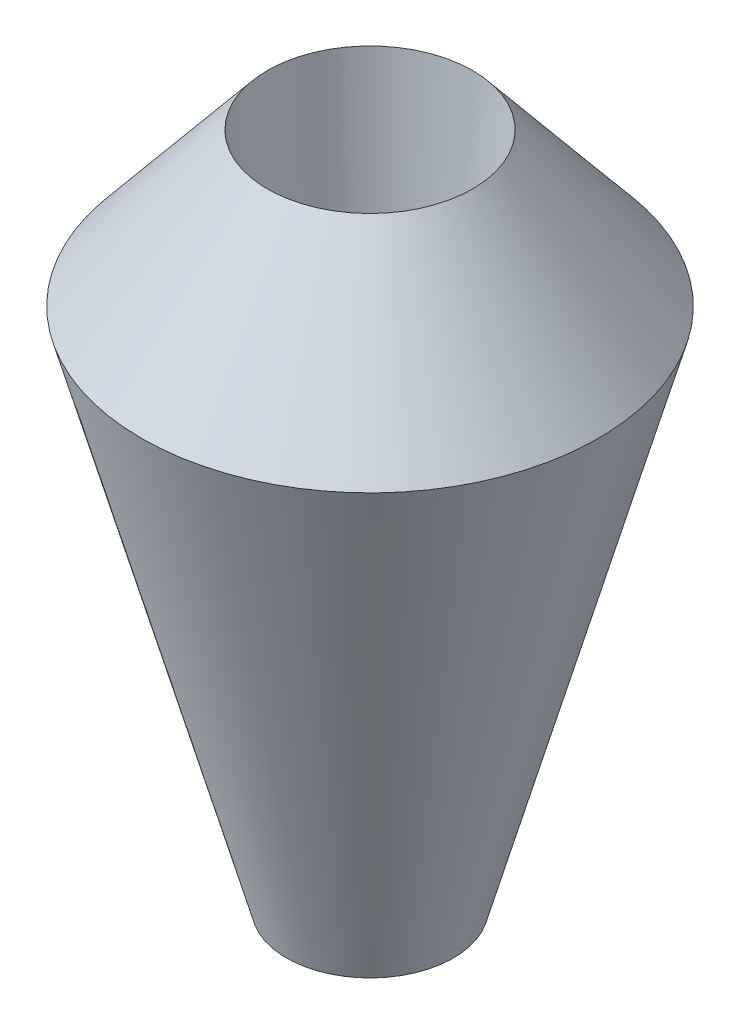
ISO-10303-21;
HEADER;
FILE_DESCRIPTION(('STEP AP214'),'2;1');
FILE_NAME('part.step','',(''),(''),'','','');
FILE_SCHEMA(('AUTOMOTIVE_DESIGN { 1 0 10303 214 1 1 1 1 }'));
ENDSEC;
DATA;
#1=APPLICATION_CONTEXT('core data for automotive mechanical design processes');
#2=APPLICATION_PROTOCOL_DEFINITION('international standard','automotive_design',2000,#1);
#3=PRODUCT_CONTEXT('',#1,'mechanical');
#4=PRODUCT('Part','Part','',(#3));
#5=PRODUCT_RELATED_PRODUCT_CATEGORY('part','',(#4));
#6=PRODUCT_DEFINITION_FORMATION('','',#4);
#7=PRODUCT_DEFINITION_CONTEXT('part definition',#1,'design');
#8=PRODUCT_DEFINITION('design','',#6,#7);
#9=PRODUCT_DEFINITION_SHAPE('','',#8);
#10=(LENGTH_UNIT() NAMED_UNIT(*) SI_UNIT(.MILLI.,.METRE.));
#11=(NAMED_UNIT(*) PLANE_ANGLE_UNIT() SI_UNIT($,.RADIAN.));
#12=(NAMED_UNIT(*) SI_UNIT($,.STERADIAN.) SOLID_ANGLE_UNIT());
#13=UNCERTAINTY_MEASURE_WITH_UNIT(LENGTH_MEASURE(1.E-05),#10,'distance_accuracy_value','');
#14=(GEOMETRIC_REPRESENTATION_CONTEXT(3) GLOBAL_UNCERTAINTY_ASSIGNED_CONTEXT((#13)) GLOBAL_UNIT_ASSIGNED_CONTEXT((#10,
#11,#12)) REPRESENTATION_CONTEXT('',''));
#15=CARTESIAN_POINT('',(0.,0.,0.));
#16=DIRECTION('',(0.,0.,1.));
#17=DIRECTION('',(1.,0.,0.));
#18=AXIS2_PLACEMENT_3D('',#15,#16,#17);
#19=CARTESIAN_POINT('',(6.61785085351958,0.,0.));
#20=DIRECTION('',(0.,-1.,0.));
#21=DIRECTION('',(0.,0.,-1.));
#22=AXIS2_PLACEMENT_3D('',#19,#20,#21);
#23=PLANE('',#22);
#24=CARTESIAN_POINT('',(0.,0.,0.));
#25=DIRECTION('',(0.,-1.,0.));
#26=DIRECTION('',(0.,0.,-1.));
#27=AXIS2_PLACEMENT_3D('',#24,#25,#26);
#28=CIRCLE('',#27,11.3512260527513);
#29=CARTESIAN_POINT('',(0.,0.,-11.3512260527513));
#30=VERTEX_POINT('',#29);
#31=EDGE_CURVE('E44',#30,#30,#28,.T.);
#32=ORIENTED_EDGE('',*,*,#31,.T.);
#33=EDGE_LOOP('',(#32));
#34=FACE_BOUND('',#33,.T.);
#35=CARTESIAN_POINT('',(0.,0.,0.));
#36=DIRECTION('',(0.,-1.,0.));
#37=DIRECTION('',(0.,0.,-1.));
#38=AXIS2_PLACEMENT_3D('',#35,#36,#37);
#39=CIRCLE('',#38,6.61785085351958);
#40=CARTESIAN_POINT('',(0.,0.,-6.61785085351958));
#41=VERTEX_POINT('',#40);
#42=EDGE_CURVE('E10',#41,#41,#39,.T.);
#43=ORIENTED_EDGE('',*,*,#42,.F.);
#44=EDGE_LOOP('',(#43));
#45=FACE_BOUND('',#44,.T.);
#46=ADVANCED_FACE('F30',(#34,#45),#23,.T.);
#47=CARTESIAN_POINT('',(0.,91.8668136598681,0.));
#48=DIRECTION('',(0.,1.,0.));
#49=DIRECTION('',(0.,0.,1.));
#50=AXIS2_PLACEMENT_3D('',#47,#48,#49);
#51=CONICAL_SURFACE('',#50,13.9563269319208,0.0797124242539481);
#52=ORIENTED_EDGE('',*,*,#42,.T.);
#53=EDGE_LOOP('',(#52));
#54=FACE_BOUND('',#53,.T.);
#55=CARTESIAN_POINT('',(0.,91.8668136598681,0.));
#56=DIRECTION('',(0.,-1.,0.));
#57=DIRECTION('',(0.,0.,-1.));
#58=AXIS2_PLACEMENT_3D('',#55,#56,#57);
#59=CIRCLE('',#58,13.9563269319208);
#60=CARTESIAN_POINT('',(0.,91.8668136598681,-13.9563269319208));
#61=VERTEX_POINT('',#60);
#62=EDGE_CURVE('E36',#61,#61,#59,.T.);
#63=ORIENTED_EDGE('',*,*,#62,.F.);
#64=EDGE_LOOP('',(#63));
#65=FACE_BOUND('',#64,.T.);
#66=ADVANCED_FACE('F60',(#54,#65),#51,.F.);
#67=CARTESIAN_POINT('',(0.,71.0777751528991,0.));
#68=DIRECTION('',(0.,-1.,0.));
#69=DIRECTION('',(0.,0.,-1.));
#70=AXIS2_PLACEMENT_3D('',#67,#68,#69);
#71=CONICAL_SURFACE('',#70,31.0880345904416,0.68924885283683);
#72=ORIENTED_EDGE('',*,*,#62,.T.);
#73=EDGE_LOOP('',(#72));
#74=FACE_BOUND('',#73,.T.);
#75=CARTESIAN_POINT('',(0.,71.0777751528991,0.));
#76=DIRECTION('',(0.,-1.,0.));
#77=DIRECTION('',(0.,0.,-1.));
#78=AXIS2_PLACEMENT_3D('',#75,#76,#77);
#79=CIRCLE('',#78,31.0880345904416);
#80=CARTESIAN_POINT('',(0.,71.0777751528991,-31.0880345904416));
#81=VERTEX_POINT('',#80);
#82=EDGE_CURVE('E40',#81,#81,#79,.T.);
#83=ORIENTED_EDGE('',*,*,#82,.F.);
#84=EDGE_LOOP('',(#83));
#85=FACE_BOUND('',#84,.T.);
#86=ADVANCED_FACE('F54',(#74,#85),#71,.T.);
#87=CARTESIAN_POINT('',(0.,0.,0.));
#88=DIRECTION('',(0.,1.,0.));
#89=DIRECTION('',(0.,0.,1.));
#90=AXIS2_PLACEMENT_3D('',#87,#88,#89);
#91=CONICAL_SURFACE('',#90,11.3512260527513,0.27085518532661);
#92=ORIENTED_EDGE('',*,*,#82,.T.);
#93=EDGE_LOOP('',(#92));
#94=FACE_BOUND('',#93,.T.);
#95=ORIENTED_EDGE('',*,*,#31,.F.);
#96=EDGE_LOOP('',(#95));
#97=FACE_BOUND('',#96,.T.);
#98=ADVANCED_FACE('F52',(#94,#97),#91,.T.);
#99=CLOSED_SHELL('',(#46,#66,#86,#98));
#100=MANIFOLD_SOLID_BREP('B2',#99);
#101=ADVANCED_BREP_SHAPE_REPRESENTATION('',(#18,#100),#14);
#102=SHAPE_DEFINITION_REPRESENTATION(#9,#101);
ENDSEC;
END-ISO-10303-21;
